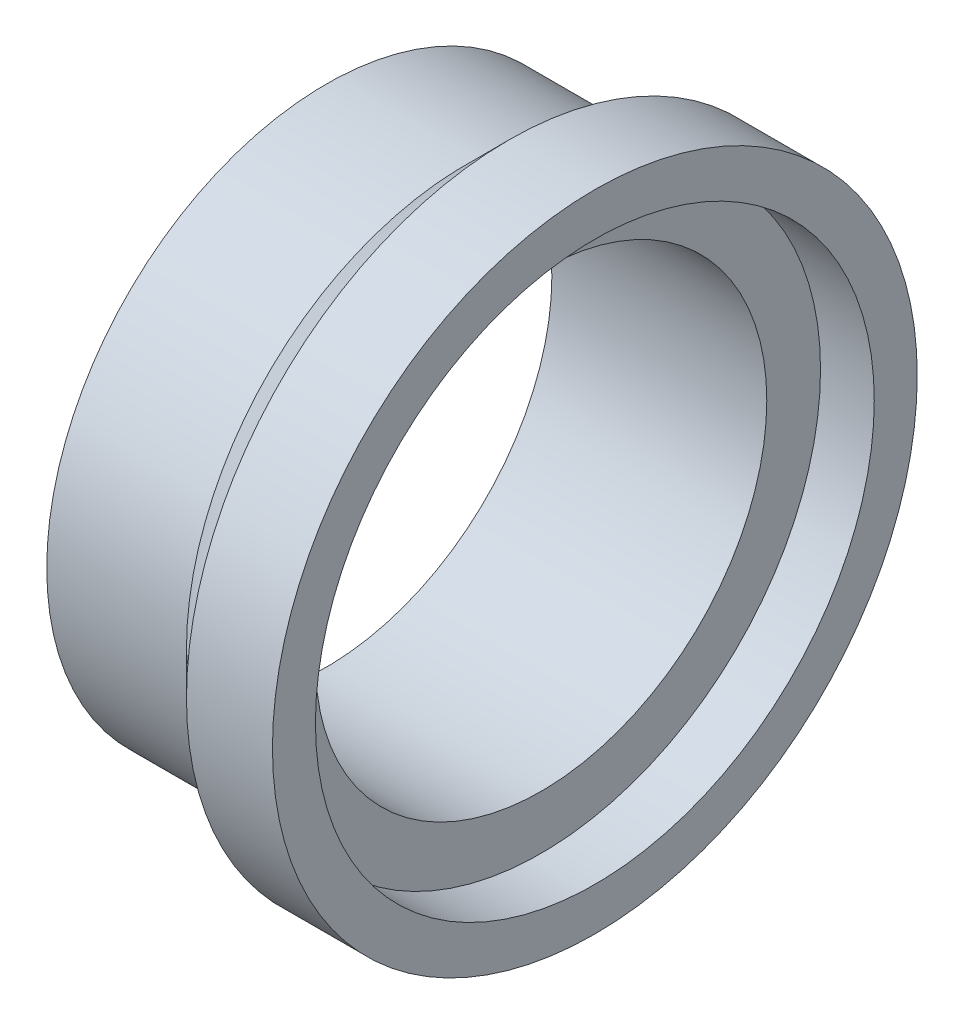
ISO-10303-21;
HEADER;
FILE_DESCRIPTION(('STEP AP214'),'2;1');
FILE_NAME('part.step','',(''),(''),'','','');
FILE_SCHEMA(('AUTOMOTIVE_DESIGN { 1 0 10303 214 1 1 1 1 }'));
ENDSEC;
DATA;
#1=APPLICATION_CONTEXT('core data for automotive mechanical design processes');
#2=APPLICATION_PROTOCOL_DEFINITION('international standard','automotive_design',2000,#1);
#3=PRODUCT_CONTEXT('',#1,'mechanical');
#4=PRODUCT('Part','Part','',(#3));
#5=PRODUCT_RELATED_PRODUCT_CATEGORY('part','',(#4));
#6=PRODUCT_DEFINITION_FORMATION('','',#4);
#7=PRODUCT_DEFINITION_CONTEXT('part definition',#1,'design');
#8=PRODUCT_DEFINITION('design','',#6,#7);
#9=PRODUCT_DEFINITION_SHAPE('','',#8);
#10=(LENGTH_UNIT() NAMED_UNIT(*) SI_UNIT(.MILLI.,.METRE.));
#11=(NAMED_UNIT(*) PLANE_ANGLE_UNIT() SI_UNIT($,.RADIAN.));
#12=(NAMED_UNIT(*) SI_UNIT($,.STERADIAN.) SOLID_ANGLE_UNIT());
#13=UNCERTAINTY_MEASURE_WITH_UNIT(LENGTH_MEASURE(1.E-05),#10,'distance_accuracy_value','');
#14=(GEOMETRIC_REPRESENTATION_CONTEXT(3) GLOBAL_UNCERTAINTY_ASSIGNED_CONTEXT((#13)) GLOBAL_UNIT_ASSIGNED_CONTEXT((#10,
#11,#12)) REPRESENTATION_CONTEXT('',''));
#15=CARTESIAN_POINT('',(0.,0.,0.));
#16=DIRECTION('',(0.,0.,1.));
#17=DIRECTION('',(1.,0.,0.));
#18=AXIS2_PLACEMENT_3D('',#15,#16,#17);
#19=CARTESIAN_POINT('',(12.5,0.,0.));
#20=DIRECTION('',(1.,0.,0.));
#21=DIRECTION('',(0.,0.,-1.));
#22=AXIS2_PLACEMENT_3D('',#19,#20,#21);
#23=CYLINDRICAL_SURFACE('',#22,15.);
#24=CARTESIAN_POINT('',(12.5,0.,0.));
#25=DIRECTION('',(1.,0.,0.));
#26=DIRECTION('',(0.,0.,-1.));
#27=AXIS2_PLACEMENT_3D('',#24,#25,#26);
#28=CIRCLE('',#27,15.);
#29=CARTESIAN_POINT('',(12.5,0.,-15.));
#30=VERTEX_POINT('',#29);
#31=EDGE_CURVE('E18',#30,#30,#28,.T.);
#32=ORIENTED_EDGE('',*,*,#31,.F.);
#33=EDGE_LOOP('',(#32));
#34=FACE_BOUND('',#33,.T.);
#35=CARTESIAN_POINT('',(8.50000206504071,0.,0.));
#36=DIRECTION('',(1.,0.,0.));
#37=DIRECTION('',(0.,0.,-1.));
#38=AXIS2_PLACEMENT_3D('',#35,#36,#37);
#39=CIRCLE('',#38,14.9999987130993);
#40=CARTESIAN_POINT('',(8.50000206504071,0.,-14.9999987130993));
#41=VERTEX_POINT('',#40);
#42=EDGE_CURVE('E30',#41,#41,#39,.F.);
#43=ORIENTED_EDGE('',*,*,#42,.F.);
#44=EDGE_LOOP('',(#43));
#45=FACE_BOUND('',#44,.T.);
#46=ADVANCED_FACE('F14',(#34,#45),#23,.T.);
#47=CARTESIAN_POINT('',(8.50000206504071,0.,0.));
#48=DIRECTION('',(1.,0.,0.));
#49=DIRECTION('',(0.,0.,-1.));
#50=AXIS2_PLACEMENT_3D('',#47,#48,#49);
#51=CONICAL_SURFACE('',#50,14.9999987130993,0.785398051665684);
#52=ORIENTED_EDGE('',*,*,#42,.T.);
#53=EDGE_LOOP('',(#52));
#54=FACE_BOUND('',#53,.T.);
#55=CARTESIAN_POINT('',(6.500002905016,0.,0.));
#56=DIRECTION('',(1.,0.,0.));
#57=DIRECTION('',(0.,0.,-1.));
#58=AXIS2_PLACEMENT_3D('',#55,#56,#57);
#59=CIRCLE('',#58,13.);
#60=CARTESIAN_POINT('',(6.500002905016,0.,-13.));
#61=VERTEX_POINT('',#60);
#62=EDGE_CURVE('E39',#61,#61,#59,.F.);
#63=ORIENTED_EDGE('',*,*,#62,.F.);
#64=EDGE_LOOP('',(#63));
#65=FACE_BOUND('',#64,.T.);
#66=ADVANCED_FACE('F51',(#54,#65),#51,.T.);
#67=CARTESIAN_POINT('',(12.5,0.,0.));
#68=DIRECTION('',(1.,0.,0.));
#69=DIRECTION('',(0.,0.,-1.));
#70=AXIS2_PLACEMENT_3D('',#67,#68,#69);
#71=PLANE('',#70);
#72=CARTESIAN_POINT('',(12.5,0.,0.));
#73=DIRECTION('',(1.,0.,0.));
#74=DIRECTION('',(0.,0.,-1.));
#75=AXIS2_PLACEMENT_3D('',#72,#73,#74);
#76=CIRCLE('',#75,13.);
#77=CARTESIAN_POINT('',(12.5,0.,-13.));
#78=VERTEX_POINT('',#77);
#79=EDGE_CURVE('E37',#78,#78,#76,.F.);
#80=ORIENTED_EDGE('',*,*,#79,.T.);
#81=EDGE_LOOP('',(#80));
#82=FACE_BOUND('',#81,.T.);
#83=ORIENTED_EDGE('',*,*,#31,.T.);
#84=EDGE_LOOP('',(#83));
#85=FACE_BOUND('',#84,.T.);
#86=ADVANCED_FACE('F61',(#82,#85),#71,.T.);
#87=CARTESIAN_POINT('',(0.,0.,0.));
#88=DIRECTION('',(1.,0.,0.));
#89=DIRECTION('',(0.,0.,-1.));
#90=AXIS2_PLACEMENT_3D('',#87,#88,#89);
#91=CYLINDRICAL_SURFACE('',#90,13.);
#92=ORIENTED_EDGE('',*,*,#62,.T.);
#93=EDGE_LOOP('',(#92));
#94=FACE_BOUND('',#93,.T.);
#95=CARTESIAN_POINT('',(0.,0.,0.));
#96=DIRECTION('',(1.,0.,0.));
#97=DIRECTION('',(0.,0.,-1.));
#98=AXIS2_PLACEMENT_3D('',#95,#96,#97);
#99=CIRCLE('',#98,13.);
#100=CARTESIAN_POINT('',(0.,0.,-13.));
#101=VERTEX_POINT('',#100);
#102=EDGE_CURVE('E35',#101,#101,#99,.T.);
#103=ORIENTED_EDGE('',*,*,#102,.T.);
#104=EDGE_LOOP('',(#103));
#105=FACE_BOUND('',#104,.T.);
#106=ADVANCED_FACE('F79',(#94,#105),#91,.T.);
#107=CARTESIAN_POINT('',(12.5,0.,0.));
#108=DIRECTION('',(1.,0.,0.));
#109=DIRECTION('',(0.,0.,-1.));
#110=AXIS2_PLACEMENT_3D('',#107,#108,#109);
#111=CYLINDRICAL_SURFACE('',#110,13.);
#112=ORIENTED_EDGE('',*,*,#79,.F.);
#113=EDGE_LOOP('',(#112));
#114=FACE_BOUND('',#113,.T.);
#115=CARTESIAN_POINT('',(10.,0.,0.));
#116=DIRECTION('',(1.,0.,0.));
#117=DIRECTION('',(0.,0.,-1.));
#118=AXIS2_PLACEMENT_3D('',#115,#116,#117);
#119=CIRCLE('',#118,13.);
#120=CARTESIAN_POINT('',(10.,0.,-13.));
#121=VERTEX_POINT('',#120);
#122=EDGE_CURVE('E27',#121,#121,#119,.T.);
#123=ORIENTED_EDGE('',*,*,#122,.F.);
#124=EDGE_LOOP('',(#123));
#125=FACE_BOUND('',#124,.T.);
#126=ADVANCED_FACE('F75',(#114,#125),#111,.F.);
#127=CARTESIAN_POINT('',(0.,0.,0.));
#128=DIRECTION('',(1.,0.,0.));
#129=DIRECTION('',(0.,0.,-1.));
#130=AXIS2_PLACEMENT_3D('',#127,#128,#129);
#131=PLANE('',#130);
#132=CARTESIAN_POINT('',(0.,0.,0.));
#133=DIRECTION('',(1.,0.,0.));
#134=DIRECTION('',(0.,0.,-1.));
#135=AXIS2_PLACEMENT_3D('',#132,#133,#134);
#136=CIRCLE('',#135,10.5);
#137=CARTESIAN_POINT('',(0.,0.,-10.5));
#138=VERTEX_POINT('',#137);
#139=EDGE_CURVE('E22',#138,#138,#136,.T.);
#140=ORIENTED_EDGE('',*,*,#139,.T.);
#141=EDGE_LOOP('',(#140));
#142=FACE_BOUND('',#141,.T.);
#143=ORIENTED_EDGE('',*,*,#102,.F.);
#144=EDGE_LOOP('',(#143));
#145=FACE_BOUND('',#144,.T.);
#146=ADVANCED_FACE('F69',(#142,#145),#131,.F.);
#147=CARTESIAN_POINT('',(10.,0.,0.));
#148=DIRECTION('',(1.,0.,0.));
#149=DIRECTION('',(0.,0.,-1.));
#150=AXIS2_PLACEMENT_3D('',#147,#148,#149);
#151=PLANE('',#150);
#152=CARTESIAN_POINT('',(10.,0.,0.));
#153=DIRECTION('',(1.,0.,0.));
#154=DIRECTION('',(0.,0.,-1.));
#155=AXIS2_PLACEMENT_3D('',#152,#153,#154);
#156=CIRCLE('',#155,10.5);
#157=CARTESIAN_POINT('',(10.,0.,-10.5));
#158=VERTEX_POINT('',#157);
#159=EDGE_CURVE('E10',#158,#158,#156,.F.);
#160=ORIENTED_EDGE('',*,*,#159,.T.);
#161=EDGE_LOOP('',(#160));
#162=FACE_BOUND('',#161,.T.);
#163=ORIENTED_EDGE('',*,*,#122,.T.);
#164=EDGE_LOOP('',(#163));
#165=FACE_BOUND('',#164,.T.);
#166=ADVANCED_FACE('F64',(#162,#165),#151,.T.);
#167=CARTESIAN_POINT('',(0.,0.,0.));
#168=DIRECTION('',(1.,0.,0.));
#169=DIRECTION('',(0.,0.,-1.));
#170=AXIS2_PLACEMENT_3D('',#167,#168,#169);
#171=CYLINDRICAL_SURFACE('',#170,10.5);
#172=ORIENTED_EDGE('',*,*,#159,.F.);
#173=EDGE_LOOP('',(#172));
#174=FACE_BOUND('',#173,.T.);
#175=ORIENTED_EDGE('',*,*,#139,.F.);
#176=EDGE_LOOP('',(#175));
#177=FACE_BOUND('',#176,.T.);
#178=ADVANCED_FACE('F16',(#174,#177),#171,.F.);
#179=CLOSED_SHELL('',(#46,#66,#86,#106,#126,#146,#166,#178));
#180=MANIFOLD_SOLID_BREP('B1',#179);
#181=ADVANCED_BREP_SHAPE_REPRESENTATION('',(#18,#180),#14);
#182=SHAPE_DEFINITION_REPRESENTATION(#9,#181);
ENDSEC;
END-ISO-10303-21;
